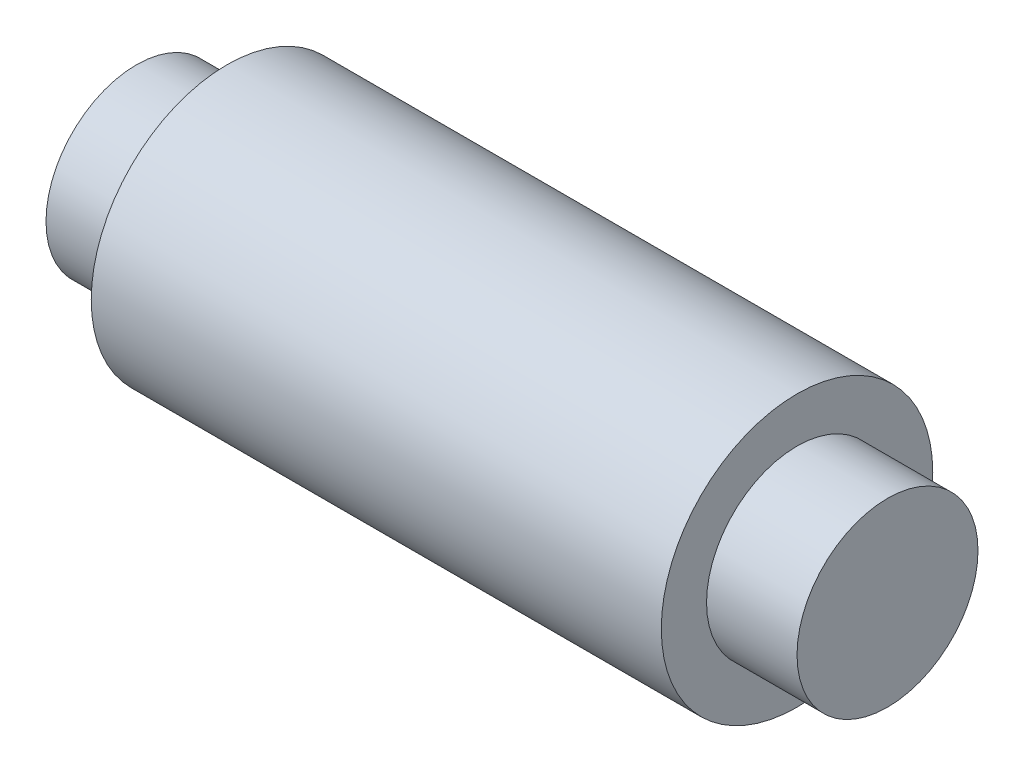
from build123d import *


with BuildPart() as part:
    # Esquisse1 → R_volution1 (revolve)
    with BuildSketch(Plane.XY, mode=Mode.PRIVATE) as r_volution1_sk:
        Polygon((0, 0), (0, 10), (10, 10), (10, 15), (73, 15), (73, 10), (83, 10), (83, 0), align=None)
    revolve(r_volution1_sk.sketch.rotate(Axis((0, 0, 0), (1, 0, 0)), 90), axis=Axis((0, 0, 0), (1, 0, 0)))


solid = part.part
